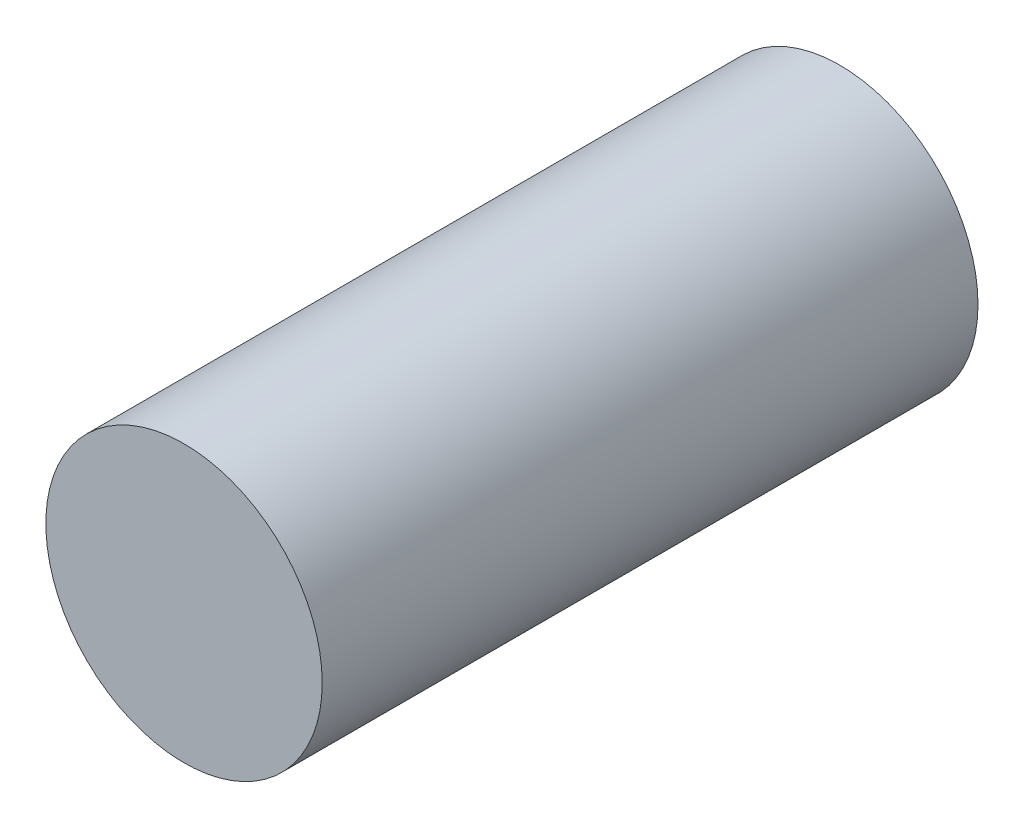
from build123d import *

# Parameters (mm, degrees)
SKETCH1_R           = 2.95
BOSS_EXTRUDE1_DEPTH = 14


with BuildPart() as part:
    # Sketch1 → Boss-Extrude1 (new body)
    with BuildSketch(Plane.XY):
        Circle(SKETCH1_R)
    extrude(amount=BOSS_EXTRUDE1_DEPTH)


solid = part.part
